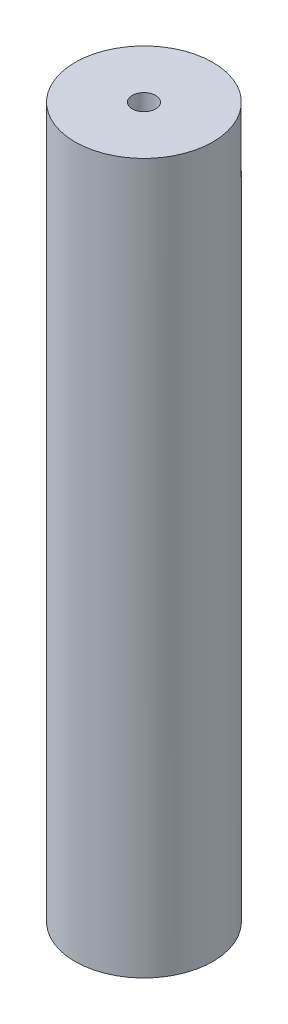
ISO-10303-21;
HEADER;
FILE_DESCRIPTION(('STEP AP214'),'2;1');
FILE_NAME('part.step','',(''),(''),'','','');
FILE_SCHEMA(('AUTOMOTIVE_DESIGN { 1 0 10303 214 1 1 1 1 }'));
ENDSEC;
DATA;
#1=APPLICATION_CONTEXT('core data for automotive mechanical design processes');
#2=APPLICATION_PROTOCOL_DEFINITION('international standard','automotive_design',2000,#1);
#3=PRODUCT_CONTEXT('',#1,'mechanical');
#4=PRODUCT('Part','Part','',(#3));
#5=PRODUCT_RELATED_PRODUCT_CATEGORY('part','',(#4));
#6=PRODUCT_DEFINITION_FORMATION('','',#4);
#7=PRODUCT_DEFINITION_CONTEXT('part definition',#1,'design');
#8=PRODUCT_DEFINITION('design','',#6,#7);
#9=PRODUCT_DEFINITION_SHAPE('','',#8);
#10=(LENGTH_UNIT() NAMED_UNIT(*) SI_UNIT(.MILLI.,.METRE.));
#11=(NAMED_UNIT(*) PLANE_ANGLE_UNIT() SI_UNIT($,.RADIAN.));
#12=(NAMED_UNIT(*) SI_UNIT($,.STERADIAN.) SOLID_ANGLE_UNIT());
#13=UNCERTAINTY_MEASURE_WITH_UNIT(LENGTH_MEASURE(1.E-05),#10,'distance_accuracy_value','');
#14=(GEOMETRIC_REPRESENTATION_CONTEXT(3) GLOBAL_UNCERTAINTY_ASSIGNED_CONTEXT((#13)) GLOBAL_UNIT_ASSIGNED_CONTEXT((#10,
#11,#12)) REPRESENTATION_CONTEXT('',''));
#15=CARTESIAN_POINT('',(0.,0.,0.));
#16=DIRECTION('',(0.,0.,1.));
#17=DIRECTION('',(1.,0.,0.));
#18=AXIS2_PLACEMENT_3D('',#15,#16,#17);
#19=CARTESIAN_POINT('',(15.,220.,-111.5));
#20=DIRECTION('',(0.,-1.,0.));
#21=DIRECTION('',(0.,0.,-1.));
#22=AXIS2_PLACEMENT_3D('',#19,#20,#21);
#23=PLANE('',#22);
#24=CARTESIAN_POINT('',(15.,220.,-111.5));
#25=DIRECTION('',(0.,-1.,0.));
#26=DIRECTION('',(0.,0.,-1.));
#27=AXIS2_PLACEMENT_3D('',#24,#25,#26);
#28=CIRCLE('',#27,1.7);
#29=CARTESIAN_POINT('',(15.,220.,-113.2));
#30=VERTEX_POINT('',#29);
#31=EDGE_CURVE('E59',#30,#30,#28,.T.);
#32=ORIENTED_EDGE('',*,*,#31,.T.);
#33=EDGE_LOOP('',(#32));
#34=FACE_BOUND('',#33,.T.);
#35=CARTESIAN_POINT('',(15.,220.,-111.5));
#36=DIRECTION('',(0.,-1.,0.));
#37=DIRECTION('',(0.,0.,-1.));
#38=AXIS2_PLACEMENT_3D('',#35,#36,#37);
#39=CIRCLE('',#38,10.);
#40=CARTESIAN_POINT('',(15.,220.,-121.5));
#41=VERTEX_POINT('',#40);
#42=EDGE_CURVE('E47',#41,#41,#39,.T.);
#43=ORIENTED_EDGE('',*,*,#42,.F.);
#44=EDGE_LOOP('',(#43));
#45=FACE_BOUND('',#44,.T.);
#46=ADVANCED_FACE('F37',(#34,#45),#23,.F.);
#47=CARTESIAN_POINT('',(15.,90.7157287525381,-111.5));
#48=DIRECTION('',(0.,1.,0.));
#49=DIRECTION('',(0.,0.,1.));
#50=AXIS2_PLACEMENT_3D('',#47,#48,#49);
#51=CYLINDRICAL_SURFACE('',#50,10.);
#52=CARTESIAN_POINT('',(15.,117.,-111.5));
#53=DIRECTION('',(0.,1.,0.));
#54=DIRECTION('',(0.,0.,1.));
#55=AXIS2_PLACEMENT_3D('',#52,#53,#54);
#56=CIRCLE('',#55,10.);
#57=CARTESIAN_POINT('',(15.,117.,-101.5));
#58=VERTEX_POINT('',#57);
#59=EDGE_CURVE('E12',#58,#58,#56,.T.);
#60=ORIENTED_EDGE('',*,*,#59,.T.);
#61=EDGE_LOOP('',(#60));
#62=FACE_BOUND('',#61,.T.);
#63=ORIENTED_EDGE('',*,*,#42,.T.);
#64=EDGE_LOOP('',(#63));
#65=FACE_BOUND('',#64,.T.);
#66=ADVANCED_FACE('F75',(#62,#65),#51,.T.);
#67=CARTESIAN_POINT('',(-225.,117.,-20.0000000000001));
#68=DIRECTION('',(0.,1.,0.));
#69=DIRECTION('',(0.,0.,1.));
#70=AXIS2_PLACEMENT_3D('',#67,#68,#69);
#71=PLANE('',#70);
#72=CARTESIAN_POINT('',(15.,117.,-111.5));
#73=DIRECTION('',(0.,1.,0.));
#74=DIRECTION('',(0.,0.,1.));
#75=AXIS2_PLACEMENT_3D('',#72,#73,#74);
#76=CIRCLE('',#75,1.69999999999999);
#77=CARTESIAN_POINT('',(15.,117.,-109.8));
#78=VERTEX_POINT('',#77);
#79=EDGE_CURVE('E66',#78,#78,#76,.T.);
#80=ORIENTED_EDGE('',*,*,#79,.T.);
#81=EDGE_LOOP('',(#80));
#82=FACE_BOUND('',#81,.T.);
#83=ORIENTED_EDGE('',*,*,#59,.F.);
#84=EDGE_LOOP('',(#83));
#85=FACE_BOUND('',#84,.T.);
#86=ADVANCED_FACE('F82',(#82,#85),#71,.F.);
#87=CARTESIAN_POINT('',(15.,110.,-111.5));
#88=DIRECTION('',(0.,-1.,0.));
#89=DIRECTION('',(0.,0.,-1.));
#90=AXIS2_PLACEMENT_3D('',#87,#88,#89);
#91=CYLINDRICAL_SURFACE('',#90,1.69999999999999);
#92=CARTESIAN_POINT('',(15.,130.833366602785,-111.5));
#93=DIRECTION('',(0.,-1.,0.));
#94=DIRECTION('',(0.,0.,-1.));
#95=AXIS2_PLACEMENT_3D('',#92,#93,#94);
#96=CIRCLE('',#95,1.69999999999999);
#97=CARTESIAN_POINT('',(15.,130.833366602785,-113.2));
#98=VERTEX_POINT('',#97);
#99=EDGE_CURVE('E61',#98,#98,#96,.T.);
#100=ORIENTED_EDGE('',*,*,#99,.F.);
#101=EDGE_LOOP('',(#100));
#102=FACE_BOUND('',#101,.T.);
#103=ORIENTED_EDGE('',*,*,#79,.F.);
#104=EDGE_LOOP('',(#103));
#105=FACE_BOUND('',#104,.T.);
#106=ADVANCED_FACE('F86',(#102,#105),#91,.F.);
#107=CARTESIAN_POINT('',(15.,131.142832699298,-111.5));
#108=DIRECTION('',(0.,-1.,0.));
#109=DIRECTION('',(0.,0.,-1.));
#110=AXIS2_PLACEMENT_3D('',#107,#108,#109);
#111=CONICAL_SURFACE('',#110,1.18496192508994,1.02974425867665);
#112=CARTESIAN_POINT('',(15.,131.854829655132,-111.5));
#113=VERTEX_POINT('',#112);
#114=VERTEX_LOOP('',#113);
#115=FACE_BOUND('',#114,.T.);
#116=ORIENTED_EDGE('',*,*,#99,.T.);
#117=EDGE_LOOP('',(#116));
#118=FACE_BOUND('',#117,.T.);
#119=ADVANCED_FACE('F90',(#115,#118),#111,.F.);
#120=CARTESIAN_POINT('',(15.,229.,-111.5));
#121=DIRECTION('',(0.,1.,0.));
#122=DIRECTION('',(0.,0.,1.));
#123=AXIS2_PLACEMENT_3D('',#120,#121,#122);
#124=CYLINDRICAL_SURFACE('',#123,1.7);
#125=CARTESIAN_POINT('',(15.,208.166633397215,-111.5));
#126=DIRECTION('',(0.,1.,0.));
#127=DIRECTION('',(0.,0.,1.));
#128=AXIS2_PLACEMENT_3D('',#125,#126,#127);
#129=CIRCLE('',#128,1.7);
#130=CARTESIAN_POINT('',(15.,208.166633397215,-109.8));
#131=VERTEX_POINT('',#130);
#132=EDGE_CURVE('E41',#131,#131,#129,.T.);
#133=ORIENTED_EDGE('',*,*,#132,.F.);
#134=EDGE_LOOP('',(#133));
#135=FACE_BOUND('',#134,.T.);
#136=ORIENTED_EDGE('',*,*,#31,.F.);
#137=EDGE_LOOP('',(#136));
#138=FACE_BOUND('',#137,.T.);
#139=ADVANCED_FACE('F55',(#135,#138),#124,.F.);
#140=CARTESIAN_POINT('',(15.,207.857167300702,-111.5));
#141=DIRECTION('',(0.,1.,0.));
#142=DIRECTION('',(0.,0.,1.));
#143=AXIS2_PLACEMENT_3D('',#140,#141,#142);
#144=CONICAL_SURFACE('',#143,1.18496192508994,1.02974425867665);
#145=CARTESIAN_POINT('',(15.,207.145170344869,-111.5));
#146=VERTEX_POINT('',#145);
#147=VERTEX_LOOP('',#146);
#148=FACE_BOUND('',#147,.T.);
#149=ORIENTED_EDGE('',*,*,#132,.T.);
#150=EDGE_LOOP('',(#149));
#151=FACE_BOUND('',#150,.T.);
#152=ADVANCED_FACE('F39',(#148,#151),#144,.F.);
#153=CLOSED_SHELL('',(#46,#66,#86,#106,#119,#139,#152));
#154=MANIFOLD_SOLID_BREP('B2',#153);
#155=ADVANCED_BREP_SHAPE_REPRESENTATION('',(#18,#154),#14);
#156=SHAPE_DEFINITION_REPRESENTATION(#9,#155);
ENDSEC;
END-ISO-10303-21;
